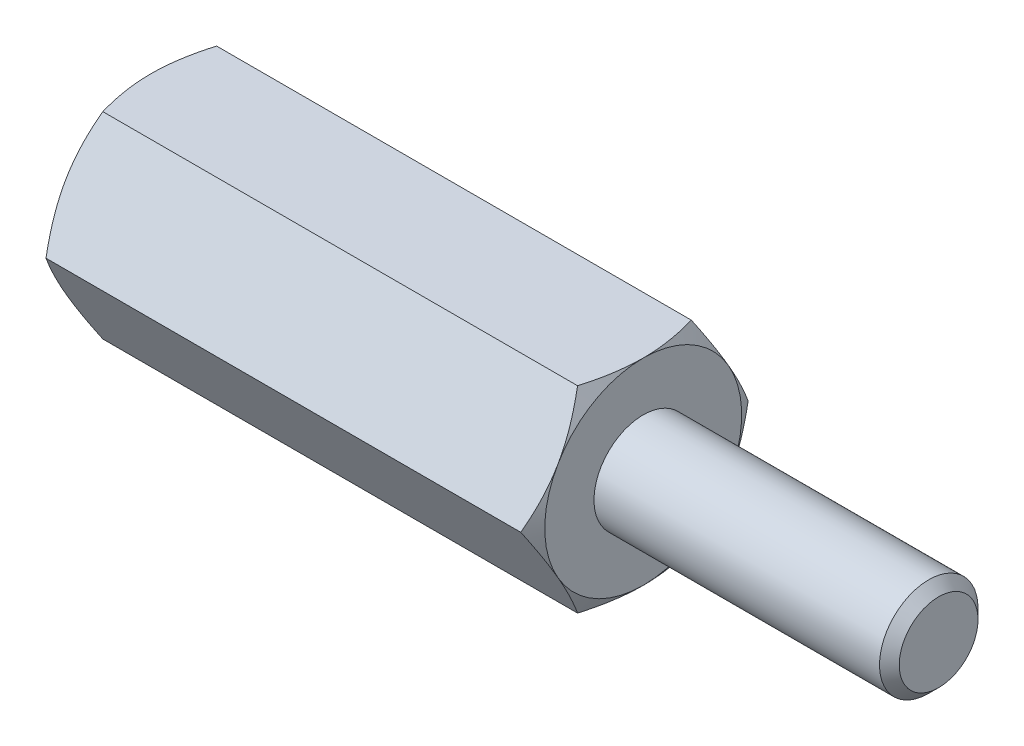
ISO-10303-21;
HEADER;
FILE_DESCRIPTION(('STEP AP214'),'2;1');
FILE_NAME('part.step','',(''),(''),'','','');
FILE_SCHEMA(('AUTOMOTIVE_DESIGN { 1 0 10303 214 1 1 1 1 }'));
ENDSEC;
DATA;
#1=APPLICATION_CONTEXT('core data for automotive mechanical design processes');
#2=APPLICATION_PROTOCOL_DEFINITION('international standard','automotive_design',2000,#1);
#3=PRODUCT_CONTEXT('',#1,'mechanical');
#4=PRODUCT('Part','Part','',(#3));
#5=PRODUCT_RELATED_PRODUCT_CATEGORY('part','',(#4));
#6=PRODUCT_DEFINITION_FORMATION('','',#4);
#7=PRODUCT_DEFINITION_CONTEXT('part definition',#1,'design');
#8=PRODUCT_DEFINITION('design','',#6,#7);
#9=PRODUCT_DEFINITION_SHAPE('','',#8);
#10=(LENGTH_UNIT() NAMED_UNIT(*) SI_UNIT(.MILLI.,.METRE.));
#11=(NAMED_UNIT(*) PLANE_ANGLE_UNIT() SI_UNIT($,.RADIAN.));
#12=(NAMED_UNIT(*) SI_UNIT($,.STERADIAN.) SOLID_ANGLE_UNIT());
#13=UNCERTAINTY_MEASURE_WITH_UNIT(LENGTH_MEASURE(1.E-05),#10,'distance_accuracy_value','');
#14=(GEOMETRIC_REPRESENTATION_CONTEXT(3) GLOBAL_UNCERTAINTY_ASSIGNED_CONTEXT((#13)) GLOBAL_UNIT_ASSIGNED_CONTEXT((#10,
#11,#12)) REPRESENTATION_CONTEXT('',''));
#15=CARTESIAN_POINT('',(0.,0.,0.));
#16=DIRECTION('',(0.,0.,1.));
#17=DIRECTION('',(1.,0.,0.));
#18=AXIS2_PLACEMENT_3D('',#15,#16,#17);
#19=CARTESIAN_POINT('',(5.,2.,-1.15470053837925));
#20=DIRECTION('',(1.,0.,0.));
#21=DIRECTION('',(0.,0.,-1.));
#22=AXIS2_PLACEMENT_3D('',#19,#20,#21);
#23=PLANE('',#22);
#24=CARTESIAN_POINT('',(5.,0.,0.));
#25=DIRECTION('',(1.,0.,0.));
#26=DIRECTION('',(0.,0.,-1.));
#27=AXIS2_PLACEMENT_3D('',#24,#25,#26);
#28=CIRCLE('',#27,2.);
#29=CARTESIAN_POINT('',(5.,-1.,-1.73205080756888));
#30=VERTEX_POINT('',#29);
#31=CARTESIAN_POINT('',(5.,0.999999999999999,-1.73205080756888));
#32=VERTEX_POINT('',#31);
#33=EDGE_CURVE('E288',#30,#32,#28,.T.);
#34=ORIENTED_EDGE('',*,*,#33,.T.);
#35=CARTESIAN_POINT('',(5.,2.,0.));
#36=VERTEX_POINT('',#35);
#37=EDGE_CURVE('E53',#32,#36,#28,.T.);
#38=ORIENTED_EDGE('',*,*,#37,.T.);
#39=CARTESIAN_POINT('',(5.,1.,1.73205080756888));
#40=VERTEX_POINT('',#39);
#41=EDGE_CURVE('E297',#36,#40,#28,.T.);
#42=ORIENTED_EDGE('',*,*,#41,.T.);
#43=CARTESIAN_POINT('',(5.,-1.,1.73205080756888));
#44=VERTEX_POINT('',#43);
#45=EDGE_CURVE('E300',#40,#44,#28,.T.);
#46=ORIENTED_EDGE('',*,*,#45,.T.);
#47=CARTESIAN_POINT('',(5.,0.,0.));
#48=DIRECTION('',(-1.,0.,0.));
#49=DIRECTION('',(0.,-1.,0.));
#50=AXIS2_PLACEMENT_3D('',#47,#48,#49);
#51=CIRCLE('',#50,2.);
#52=CARTESIAN_POINT('',(5.,-2.,0.));
#53=VERTEX_POINT('',#52);
#54=EDGE_CURVE('E193',#53,#44,#51,.T.);
#55=ORIENTED_EDGE('',*,*,#54,.F.);
#56=EDGE_CURVE('E61',#53,#30,#28,.T.);
#57=ORIENTED_EDGE('',*,*,#56,.T.);
#58=EDGE_LOOP('',(#34,#38,#42,#46,#55,#57));
#59=FACE_BOUND('',#58,.T.);
#60=CARTESIAN_POINT('',(5.,0.,0.));
#61=DIRECTION('',(1.,0.,0.));
#62=DIRECTION('',(0.,0.,-1.));
#63=AXIS2_PLACEMENT_3D('',#60,#61,#62);
#64=CIRCLE('',#63,1.);
#65=CARTESIAN_POINT('',(5.,0.,-1.));
#66=VERTEX_POINT('',#65);
#67=EDGE_CURVE('E315',#66,#66,#64,.T.);
#68=ORIENTED_EDGE('',*,*,#67,.F.);
#69=EDGE_LOOP('',(#68));
#70=FACE_BOUND('',#69,.T.);
#71=ADVANCED_FACE('F37',(#59,#70),#23,.T.);
#72=CARTESIAN_POINT('',(5.,0.,-2.3094010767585));
#73=DIRECTION('',(0.,-0.5,0.866025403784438));
#74=DIRECTION('',(0.,-0.866025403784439,-0.5));
#75=AXIS2_PLACEMENT_3D('',#72,#73,#74);
#76=PLANE('',#75);
#77=CARTESIAN_POINT('',(4.8213005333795,-0.000200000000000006,-2.30951654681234));
#78=CARTESIAN_POINT('',(4.85061046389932,0.0876912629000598,-2.25877250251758));
#79=CARTESIAN_POINT('',(4.87726714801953,0.176341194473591,-2.20759044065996));
#80=CARTESIAN_POINT('',(4.92379750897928,0.355176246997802,-2.10433997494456));
#81=CARTESIAN_POINT('',(4.94365472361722,0.445364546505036,-2.05226973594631));
#82=CARTESIAN_POINT('',(4.97456653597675,0.624623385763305,-1.94877459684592));
#83=CARTESIAN_POINT('',(4.98582684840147,0.713666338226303,-1.89736562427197));
#84=CARTESIAN_POINT('',(4.99927133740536,0.892171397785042,-1.79430568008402));
#85=CARTESIAN_POINT('',(5.00146664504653,0.981632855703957,-1.74265508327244));
#86=CARTESIAN_POINT('',(4.99690901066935,1.1488083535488,-1.64613626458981));
#87=CARTESIAN_POINT('',(4.99127512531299,1.22654737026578,-1.60125362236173));
#88=CARTESIAN_POINT('',(4.97341610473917,1.38151891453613,-1.51178075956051));
#89=CARTESIAN_POINT('',(4.96118486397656,1.4587509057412,-1.46719084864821));
#90=CARTESIAN_POINT('',(4.93060656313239,1.6140421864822,-1.37753338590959));
#91=CARTESIAN_POINT('',(4.91212983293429,1.69208181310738,-1.33247718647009));
#92=CARTESIAN_POINT('',(4.87019448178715,1.84699686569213,-1.24303693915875));
#93=CARTESIAN_POINT('',(4.84674571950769,1.92387427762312,-1.1986517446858));
#94=CARTESIAN_POINT('',(4.8213005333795,2.0002,-1.15458506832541));
#95=B_SPLINE_CURVE_WITH_KNOTS('',3,(#77,#78,#79,#80,#81,#82,#83,#84,#85,#86,#87,#88,#89,#90,#91,
#92,#93,#94),.UNSPECIFIED.,.F.,.F.,(4,2,2,2,2,2,2,2,4),(0.,0.317031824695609,0.634825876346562,
0.944753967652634,1.25430138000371,1.52387047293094,1.79368946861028,2.06949491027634,
2.34475850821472),.UNSPECIFIED.);
#96=CARTESIAN_POINT('',(4.82136720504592,0.,-2.3094010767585));
#97=VERTEX_POINT('',#96);
#98=EDGE_CURVE('E312',#97,#32,#95,.T.);
#99=ORIENTED_EDGE('',*,*,#98,.F.);
#100=DIRECTION('',(-1.,0.,0.));
#101=VECTOR('',#100,1.);
#102=CARTESIAN_POINT('',(5.,0.,-2.3094010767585));
#103=LINE('',#102,#101);
#104=CARTESIAN_POINT('',(-4.82136720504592,0.,-2.3094010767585));
#105=VERTEX_POINT('',#104);
#106=EDGE_CURVE('E264',#97,#105,#103,.T.);
#107=ORIENTED_EDGE('',*,*,#106,.T.);
#108=CARTESIAN_POINT('',(-4.8213005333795,2.0002,-1.15458506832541));
#109=CARTESIAN_POINT('',(-4.85061046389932,1.91230873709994,-1.20532911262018));
#110=CARTESIAN_POINT('',(-4.87726714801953,1.82365880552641,-1.2565111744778));
#111=CARTESIAN_POINT('',(-4.92379750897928,1.6448237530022,-1.35976164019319));
#112=CARTESIAN_POINT('',(-4.94365472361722,1.55463545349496,-1.41183187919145));
#113=CARTESIAN_POINT('',(-4.97456653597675,1.37537661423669,-1.51532701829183));
#114=CARTESIAN_POINT('',(-4.98582684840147,1.2863336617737,-1.56673599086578));
#115=CARTESIAN_POINT('',(-4.99927133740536,1.10782860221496,-1.66979593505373));
#116=CARTESIAN_POINT('',(-5.00146664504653,1.01836714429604,-1.72144653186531));
#117=CARTESIAN_POINT('',(-4.99690901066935,0.851191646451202,-1.81796535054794));
#118=CARTESIAN_POINT('',(-4.99127512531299,0.773452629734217,-1.86284799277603));
#119=CARTESIAN_POINT('',(-4.97341610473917,0.618481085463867,-1.95232085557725));
#120=CARTESIAN_POINT('',(-4.96118486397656,0.541249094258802,-1.99691076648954));
#121=CARTESIAN_POINT('',(-4.93060656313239,0.385957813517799,-2.08656822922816));
#122=CARTESIAN_POINT('',(-4.91212983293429,0.30791818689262,-2.13162442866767));
#123=CARTESIAN_POINT('',(-4.87019448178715,0.153003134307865,-2.221064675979));
#124=CARTESIAN_POINT('',(-4.84674571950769,0.0761257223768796,-2.26544987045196));
#125=CARTESIAN_POINT('',(-4.8213005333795,-0.000200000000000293,-2.30951654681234));
#126=B_SPLINE_CURVE_WITH_KNOTS('',3,(#108,#109,#110,#111,#112,#113,#114,#115,#116,#117,#118,
#119,#120,#121,#122,#123,#124,#125),.UNSPECIFIED.,.F.,.F.,(4,2,2,2,2,2,2,2,4),(0.,
0.317031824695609,0.634825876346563,0.944753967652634,1.25430138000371,1.52387047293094,
1.79368946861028,2.06949491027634,2.34475850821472),.UNSPECIFIED.);
#127=CARTESIAN_POINT('',(-5.,0.999999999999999,-1.73205080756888));
#128=VERTEX_POINT('',#127);
#129=EDGE_CURVE('E323',#128,#105,#126,.T.);
#130=ORIENTED_EDGE('',*,*,#129,.F.);
#131=CARTESIAN_POINT('',(-4.82136720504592,2.,-1.15470053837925));
#132=VERTEX_POINT('',#131);
#133=EDGE_CURVE('E325',#132,#128,#126,.T.);
#134=ORIENTED_EDGE('',*,*,#133,.F.);
#135=DIRECTION('',(-1.,0.,0.));
#136=VECTOR('',#135,1.);
#137=CARTESIAN_POINT('',(5.,2.,-1.15470053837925));
#138=LINE('',#137,#136);
#139=CARTESIAN_POINT('',(4.821367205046,2.,-1.15470053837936));
#140=VERTEX_POINT('',#139);
#141=EDGE_CURVE('E279',#140,#132,#138,.T.);
#142=ORIENTED_EDGE('',*,*,#141,.F.);
#143=EDGE_CURVE('E229',#32,#140,#95,.T.);
#144=ORIENTED_EDGE('',*,*,#143,.F.);
#145=EDGE_LOOP('',(#99,#107,#130,#134,#142,#144));
#146=FACE_BOUND('',#145,.T.);
#147=ADVANCED_FACE('F148',(#146),#76,.F.);
#148=CARTESIAN_POINT('',(5.,2.,-1.15470053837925));
#149=DIRECTION('',(0.,-1.,0.));
#150=DIRECTION('',(0.,0.,-1.));
#151=AXIS2_PLACEMENT_3D('',#148,#149,#150);
#152=PLANE('',#151);
#153=CARTESIAN_POINT('',(4.0041453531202,2.,-3.14239762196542));
#154=CARTESIAN_POINT('',(4.04685680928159,2.,-3.05468337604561));
#155=CARTESIAN_POINT('',(4.08917030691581,2.,-2.96677207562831));
#156=CARTESIAN_POINT('',(4.17277831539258,2.,-2.79045070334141));
#157=CARTESIAN_POINT('',(4.21407267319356,2.,-2.70204055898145));
#158=CARTESIAN_POINT('',(4.29561838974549,2.,-2.52418069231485));
#159=CARTESIAN_POINT('',(4.33586319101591,2.,-2.43472795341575));
#160=CARTESIAN_POINT('',(4.41475904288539,2.,-2.25512498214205));
#161=CARTESIAN_POINT('',(4.45341016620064,2.,-2.16497478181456));
#162=CARTESIAN_POINT('',(4.52996617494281,2.,-1.98078525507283));
#163=CARTESIAN_POINT('',(4.56780217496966,2.,-1.88671714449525));
#164=CARTESIAN_POINT('',(4.64070044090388,2.,-1.69751412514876));
#165=CARTESIAN_POINT('',(4.67576294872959,2.,-1.60237931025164));
#166=CARTESIAN_POINT('',(4.74223535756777,2.,-1.41102905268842));
#167=CARTESIAN_POINT('',(4.77365196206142,2.,-1.31481596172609));
#168=CARTESIAN_POINT('',(4.83184764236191,2.,-1.12101028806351));
#169=CARTESIAN_POINT('',(4.8586281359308,2.,-1.02341813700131));
#170=CARTESIAN_POINT('',(4.90615162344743,2.,-0.827336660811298));
#171=CARTESIAN_POINT('',(4.9269281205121,2.,-0.728855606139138));
#172=CARTESIAN_POINT('',(4.96129559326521,2.,-0.530628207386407));
#173=CARTESIAN_POINT('',(4.97488733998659,2.,-0.430882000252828));
#174=CARTESIAN_POINT('',(4.99362159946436,2.,-0.231937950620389));
#175=CARTESIAN_POINT('',(4.99887592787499,2.,-0.132750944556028));
#176=CARTESIAN_POINT('',(5.00079968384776,2.,0.0657049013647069));
#177=CARTESIAN_POINT('',(4.9974689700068,2.,0.164973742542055));
#178=CARTESIAN_POINT('',(4.97965125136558,2.,0.400692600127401));
#179=CARTESIAN_POINT('',(4.96138848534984,2.,0.536859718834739));
#180=CARTESIAN_POINT('',(4.91179958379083,2.,0.806792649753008));
#181=CARTESIAN_POINT('',(4.88046153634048,2.,0.9405561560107));
#182=CARTESIAN_POINT('',(4.80733694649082,2.,1.20849227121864));
#183=CARTESIAN_POINT('',(4.76532316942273,2.,1.34260127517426));
#184=CARTESIAN_POINT('',(4.69701155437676,2.,1.54188460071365));
#185=CARTESIAN_POINT('',(4.67336125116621,2.,1.6079939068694));
#186=CARTESIAN_POINT('',(4.62457310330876,2.,1.73966131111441));
#187=CARTESIAN_POINT('',(4.59943529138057,2.,1.80521942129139));
#188=CARTESIAN_POINT('',(4.53045244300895,2.,1.98014362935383));
#189=CARTESIAN_POINT('',(4.48548288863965,2.,2.08906517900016));
#190=CARTESIAN_POINT('',(4.39293953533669,2.,2.3058004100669));
#191=CARTESIAN_POINT('',(4.34536546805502,2.,2.41361397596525));
#192=CARTESIAN_POINT('',(4.24822629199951,2.,2.62838132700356));
#193=CARTESIAN_POINT('',(4.19866051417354,2.,2.7353348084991));
#194=CARTESIAN_POINT('',(4.09800140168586,2.,2.94852186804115));
#195=CARTESIAN_POINT('',(4.04690802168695,2.,3.05475542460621));
#196=CARTESIAN_POINT('',(3.89169615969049,2.,3.37291303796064));
#197=CARTESIAN_POINT('',(3.78579652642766,2.,3.58396705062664));
#198=CARTESIAN_POINT('',(3.57100981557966,2.,4.00448363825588));
#199=CARTESIAN_POINT('',(3.46212334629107,2.,4.21394652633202));
#200=CARTESIAN_POINT('',(3.25376773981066,2.,4.61000648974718));
#201=CARTESIAN_POINT('',(3.15450073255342,2.,4.79671008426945));
#202=CARTESIAN_POINT('',(2.95476413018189,2.,5.16948614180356));
#203=CARTESIAN_POINT('',(2.85429446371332,2.,5.35555856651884));
#204=CARTESIAN_POINT('',(2.6527937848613,2.,5.72660635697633));
#205=CARTESIAN_POINT('',(2.55176570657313,2.,5.91158331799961));
#206=CARTESIAN_POINT('',(2.34902395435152,2.,6.28114276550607));
#207=CARTESIAN_POINT('',(2.24731033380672,2.,6.46572528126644));
#208=CARTESIAN_POINT('',(2.14534707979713,2.,6.65016883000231));
#209=B_SPLINE_CURVE_WITH_KNOTS('',3,(#153,#154,#155,#156,#157,#158,#159,#160,#161,#162,#163,
#164,#165,#166,#167,#168,#169,#170,#171,#172,#173,#174,#175,#176,#177,#178,#179,#180,#181,#182,
#183,#184,#185,#186,#187,#188,#189,#190,#191,#192,#193,#194,#195,#196,#197,#198,#199,#200,#201,
#202,#203,#204,#205,#206,#207,#208),.UNSPECIFIED.,.F.,.F.,(4,2,2,2,2,2,2,2,2,2,2,2,2,2,2,2,2,2,
2,2,2,2,2,2,2,2,2,4),(0.,0.292684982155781,0.585413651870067,0.879667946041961,1.17390879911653,
1.47805164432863,1.78216793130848,2.08571589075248,2.38917085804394,2.690898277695,
2.99259331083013,3.29020694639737,3.58782548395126,3.99913738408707,4.41082482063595,
4.83214112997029,5.0427662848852,5.25338680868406,5.60685637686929,5.96036243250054,
6.31398824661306,6.66762456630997,7.37597688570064,8.08418599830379,8.71853756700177,
9.3529269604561,9.98522933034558,10.6174830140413),.UNSPECIFIED.);
#210=EDGE_CURVE('E227',#140,#36,#209,.T.);
#211=ORIENTED_EDGE('',*,*,#210,.F.);
#212=ORIENTED_EDGE('',*,*,#141,.T.);
#213=CARTESIAN_POINT('',(-4.0041453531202,2.,-3.14239762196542));
#214=CARTESIAN_POINT('',(-4.04685680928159,2.,-3.05468337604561));
#215=CARTESIAN_POINT('',(-4.08917030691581,2.,-2.96677207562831));
#216=CARTESIAN_POINT('',(-4.17277831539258,2.,-2.79045070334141));
#217=CARTESIAN_POINT('',(-4.21407267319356,2.,-2.70204055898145));
#218=CARTESIAN_POINT('',(-4.29561838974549,2.,-2.52418069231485));
#219=CARTESIAN_POINT('',(-4.33586319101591,2.,-2.43472795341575));
#220=CARTESIAN_POINT('',(-4.41475904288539,2.,-2.25512498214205));
#221=CARTESIAN_POINT('',(-4.45341016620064,2.,-2.16497478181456));
#222=CARTESIAN_POINT('',(-4.52996617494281,2.,-1.98078525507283));
#223=CARTESIAN_POINT('',(-4.56780217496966,2.,-1.88671714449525));
#224=CARTESIAN_POINT('',(-4.64070044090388,2.,-1.69751412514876));
#225=CARTESIAN_POINT('',(-4.67576294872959,2.,-1.60237931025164));
#226=CARTESIAN_POINT('',(-4.74223535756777,2.,-1.41102905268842));
#227=CARTESIAN_POINT('',(-4.77365196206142,2.,-1.31481596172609));
#228=CARTESIAN_POINT('',(-4.83184764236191,2.,-1.12101028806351));
#229=CARTESIAN_POINT('',(-4.8586281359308,2.,-1.02341813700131));
#230=CARTESIAN_POINT('',(-4.90615162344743,2.,-0.827336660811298));
#231=CARTESIAN_POINT('',(-4.9269281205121,2.,-0.728855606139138));
#232=CARTESIAN_POINT('',(-4.96129559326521,2.,-0.530628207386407));
#233=CARTESIAN_POINT('',(-4.97488733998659,2.,-0.430882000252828));
#234=CARTESIAN_POINT('',(-4.99362159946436,2.,-0.231937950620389));
#235=CARTESIAN_POINT('',(-4.99887592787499,2.,-0.132750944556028));
#236=CARTESIAN_POINT('',(-5.00079968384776,2.,0.0657049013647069));
#237=CARTESIAN_POINT('',(-4.9974689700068,2.,0.164973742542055));
#238=CARTESIAN_POINT('',(-4.97965125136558,2.,0.400692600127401));
#239=CARTESIAN_POINT('',(-4.96138848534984,2.,0.53685971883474));
#240=CARTESIAN_POINT('',(-4.91179958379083,2.,0.806792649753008));
#241=CARTESIAN_POINT('',(-4.88046153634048,2.,0.940556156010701));
#242=CARTESIAN_POINT('',(-4.80733694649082,2.,1.20849227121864));
#243=CARTESIAN_POINT('',(-4.76532316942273,2.,1.34260127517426));
#244=CARTESIAN_POINT('',(-4.69701155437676,2.,1.54188460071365));
#245=CARTESIAN_POINT('',(-4.67336125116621,2.,1.60799390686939));
#246=CARTESIAN_POINT('',(-4.62457310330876,2.,1.73966131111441));
#247=CARTESIAN_POINT('',(-4.59943529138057,2.,1.80521942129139));
#248=CARTESIAN_POINT('',(-4.53045244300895,2.,1.98014362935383));
#249=CARTESIAN_POINT('',(-4.48548288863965,2.,2.08906517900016));
#250=CARTESIAN_POINT('',(-4.39293953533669,2.,2.3058004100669));
#251=CARTESIAN_POINT('',(-4.34536546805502,2.,2.41361397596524));
#252=CARTESIAN_POINT('',(-4.24822629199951,2.,2.62838132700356));
#253=CARTESIAN_POINT('',(-4.19866051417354,2.,2.7353348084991));
#254=CARTESIAN_POINT('',(-4.09800140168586,2.,2.94852186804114));
#255=CARTESIAN_POINT('',(-4.04690802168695,2.,3.05475542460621));
#256=CARTESIAN_POINT('',(-3.89169615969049,2.,3.37291303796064));
#257=CARTESIAN_POINT('',(-3.78579652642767,2.,3.58396705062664));
#258=CARTESIAN_POINT('',(-3.57100981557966,2.,4.00448363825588));
#259=CARTESIAN_POINT('',(-3.46212334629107,2.,4.21394652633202));
#260=CARTESIAN_POINT('',(-3.25376773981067,2.,4.61000648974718));
#261=CARTESIAN_POINT('',(-3.15450073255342,2.,4.79671008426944));
#262=CARTESIAN_POINT('',(-2.95476413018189,2.,5.16948614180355));
#263=CARTESIAN_POINT('',(-2.85429446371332,2.,5.35555856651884));
#264=CARTESIAN_POINT('',(-2.6527937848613,2.,5.72660635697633));
#265=CARTESIAN_POINT('',(-2.55176570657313,2.,5.9115833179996));
#266=CARTESIAN_POINT('',(-2.34902395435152,2.,6.28114276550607));
#267=CARTESIAN_POINT('',(-2.24731033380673,2.,6.46572528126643));
#268=CARTESIAN_POINT('',(-2.14534707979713,2.,6.65016883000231));
#269=B_SPLINE_CURVE_WITH_KNOTS('',3,(#213,#214,#215,#216,#217,#218,#219,#220,#221,#222,#223,
#224,#225,#226,#227,#228,#229,#230,#231,#232,#233,#234,#235,#236,#237,#238,#239,#240,#241,#242,
#243,#244,#245,#246,#247,#248,#249,#250,#251,#252,#253,#254,#255,#256,#257,#258,#259,#260,#261,
#262,#263,#264,#265,#266,#267,#268),.UNSPECIFIED.,.F.,.F.,(4,2,2,2,2,2,2,2,2,2,2,2,2,2,2,2,2,2,
2,2,2,2,2,2,2,2,2,4),(0.,0.292684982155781,0.585413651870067,0.879667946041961,1.17390879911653,
1.47805164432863,1.78216793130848,2.08571589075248,2.38917085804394,2.690898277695,
2.99259331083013,3.29020694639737,3.58782548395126,3.99913738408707,4.41082482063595,
4.8321411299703,5.0427662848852,5.25338680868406,5.60685637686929,5.96036243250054,
6.31398824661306,6.66762456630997,7.37597688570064,8.08418599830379,8.71853756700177,
9.3529269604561,9.98522933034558,10.6174830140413),.UNSPECIFIED.);
#270=CARTESIAN_POINT('',(-5.,2.,0.));
#271=VERTEX_POINT('',#270);
#272=EDGE_CURVE('E241',#271,#132,#269,.F.);
#273=ORIENTED_EDGE('',*,*,#272,.F.);
#274=CARTESIAN_POINT('',(-4.82136720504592,2.,1.15470053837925));
#275=VERTEX_POINT('',#274);
#276=EDGE_CURVE('E249',#275,#271,#269,.F.);
#277=ORIENTED_EDGE('',*,*,#276,.F.);
#278=DIRECTION('',(-1.,0.,0.));
#279=VECTOR('',#278,1.);
#280=CARTESIAN_POINT('',(5.,2.,1.15470053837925));
#281=LINE('',#280,#279);
#282=CARTESIAN_POINT('',(4.82136720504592,2.,1.15470053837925));
#283=VERTEX_POINT('',#282);
#284=EDGE_CURVE('E276',#283,#275,#281,.T.);
#285=ORIENTED_EDGE('',*,*,#284,.F.);
#286=EDGE_CURVE('E221',#36,#283,#209,.T.);
#287=ORIENTED_EDGE('',*,*,#286,.F.);
#288=EDGE_LOOP('',(#211,#212,#273,#277,#285,#287));
#289=FACE_BOUND('',#288,.T.);
#290=ADVANCED_FACE('F153',(#289),#152,.F.);
#291=CARTESIAN_POINT('',(5.,2.,1.15470053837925));
#292=DIRECTION('',(0.,-0.5,-0.866025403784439));
#293=DIRECTION('',(0.,0.866025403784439,-0.5));
#294=AXIS2_PLACEMENT_3D('',#291,#292,#293);
#295=PLANE('',#294);
#296=CARTESIAN_POINT('',(4.8213005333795,2.0002,1.15458506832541));
#297=CARTESIAN_POINT('',(4.85061046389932,1.91230873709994,1.20532911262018));
#298=CARTESIAN_POINT('',(4.87726714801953,1.82365880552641,1.2565111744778));
#299=CARTESIAN_POINT('',(4.92379750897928,1.6448237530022,1.35976164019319));
#300=CARTESIAN_POINT('',(4.94365472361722,1.55463545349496,1.41183187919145));
#301=CARTESIAN_POINT('',(4.97456653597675,1.37537661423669,1.51532701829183));
#302=CARTESIAN_POINT('',(4.98582684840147,1.2863336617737,1.56673599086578));
#303=CARTESIAN_POINT('',(4.99927133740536,1.10782860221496,1.66979593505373));
#304=CARTESIAN_POINT('',(5.00146664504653,1.01836714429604,1.72144653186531));
#305=CARTESIAN_POINT('',(4.99690901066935,0.851191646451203,1.81796535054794));
#306=CARTESIAN_POINT('',(4.99127512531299,0.773452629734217,1.86284799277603));
#307=CARTESIAN_POINT('',(4.97341610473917,0.618481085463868,1.95232085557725));
#308=CARTESIAN_POINT('',(4.96118486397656,0.541249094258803,1.99691076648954));
#309=CARTESIAN_POINT('',(4.93060656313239,0.3859578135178,2.08656822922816));
#310=CARTESIAN_POINT('',(4.91212983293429,0.307918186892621,2.13162442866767));
#311=CARTESIAN_POINT('',(4.87019448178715,0.153003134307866,2.221064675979));
#312=CARTESIAN_POINT('',(4.84674571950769,0.0761257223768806,2.26544987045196));
#313=CARTESIAN_POINT('',(4.8213005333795,-0.000199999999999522,2.30951654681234));
#314=B_SPLINE_CURVE_WITH_KNOTS('',3,(#296,#297,#298,#299,#300,#301,#302,#303,#304,#305,#306,
#307,#308,#309,#310,#311,#312,#313),.UNSPECIFIED.,.F.,.F.,(4,2,2,2,2,2,2,2,4),(0.,
0.317031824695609,0.634825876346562,0.944753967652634,1.25430138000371,1.52387047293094,
1.79368946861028,2.06949491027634,2.34475850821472),.UNSPECIFIED.);
#315=EDGE_CURVE('E228',#283,#40,#314,.T.);
#316=ORIENTED_EDGE('',*,*,#315,.F.);
#317=ORIENTED_EDGE('',*,*,#284,.T.);
#318=CARTESIAN_POINT('',(-4.8213005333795,-0.000199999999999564,2.30951654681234));
#319=CARTESIAN_POINT('',(-4.85061046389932,0.0876912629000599,2.25877250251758));
#320=CARTESIAN_POINT('',(-4.87726714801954,0.176341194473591,2.20759044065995));
#321=CARTESIAN_POINT('',(-4.92379750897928,0.355176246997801,2.10433997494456));
#322=CARTESIAN_POINT('',(-4.94365472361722,0.445364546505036,2.0522697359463));
#323=CARTESIAN_POINT('',(-4.97456653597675,0.624623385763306,1.94877459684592));
#324=CARTESIAN_POINT('',(-4.98582684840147,0.713666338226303,1.89736562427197));
#325=CARTESIAN_POINT('',(-4.99927133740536,0.892171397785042,1.79430568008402));
#326=CARTESIAN_POINT('',(-5.00146664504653,0.981632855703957,1.74265508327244));
#327=CARTESIAN_POINT('',(-4.99690901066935,1.1488083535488,1.64613626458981));
#328=CARTESIAN_POINT('',(-4.99127512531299,1.22654737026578,1.60125362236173));
#329=CARTESIAN_POINT('',(-4.97341610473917,1.38151891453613,1.51178075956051));
#330=CARTESIAN_POINT('',(-4.96118486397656,1.4587509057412,1.46719084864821));
#331=CARTESIAN_POINT('',(-4.93060656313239,1.6140421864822,1.37753338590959));
#332=CARTESIAN_POINT('',(-4.91212983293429,1.69208181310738,1.33247718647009));
#333=CARTESIAN_POINT('',(-4.87019448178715,1.84699686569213,1.24303693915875));
#334=CARTESIAN_POINT('',(-4.84674571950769,1.92387427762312,1.1986517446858));
#335=CARTESIAN_POINT('',(-4.8213005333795,2.0002,1.15458506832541));
#336=B_SPLINE_CURVE_WITH_KNOTS('',3,(#318,#319,#320,#321,#322,#323,#324,#325,#326,#327,#328,
#329,#330,#331,#332,#333,#334,#335),.UNSPECIFIED.,.F.,.F.,(4,2,2,2,2,2,2,2,4),(0.,
0.317031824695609,0.634825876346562,0.944753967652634,1.25430138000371,1.52387047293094,
1.79368946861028,2.06949491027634,2.34475850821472),.UNSPECIFIED.);
#337=CARTESIAN_POINT('',(-5.,1.,1.73205080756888));
#338=VERTEX_POINT('',#337);
#339=EDGE_CURVE('E255',#338,#275,#336,.T.);
#340=ORIENTED_EDGE('',*,*,#339,.F.);
#341=CARTESIAN_POINT('',(-4.82136720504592,0.,2.3094010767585));
#342=VERTEX_POINT('',#341);
#343=EDGE_CURVE('E262',#342,#338,#336,.T.);
#344=ORIENTED_EDGE('',*,*,#343,.F.);
#345=DIRECTION('',(-1.,0.,0.));
#346=VECTOR('',#345,1.);
#347=CARTESIAN_POINT('',(5.,0.,2.3094010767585));
#348=LINE('',#347,#346);
#349=CARTESIAN_POINT('',(4.82136720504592,0.,2.3094010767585));
#350=VERTEX_POINT('',#349);
#351=EDGE_CURVE('E273',#350,#342,#348,.T.);
#352=ORIENTED_EDGE('',*,*,#351,.F.);
#353=EDGE_CURVE('E215',#40,#350,#314,.T.);
#354=ORIENTED_EDGE('',*,*,#353,.F.);
#355=EDGE_LOOP('',(#316,#317,#340,#344,#352,#354));
#356=FACE_BOUND('',#355,.T.);
#357=ADVANCED_FACE('F235',(#356),#295,.F.);
#358=CARTESIAN_POINT('',(5.,0.,2.3094010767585));
#359=DIRECTION('',(0.,0.5,-0.866025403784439));
#360=DIRECTION('',(0.,0.866025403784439,0.5));
#361=AXIS2_PLACEMENT_3D('',#358,#359,#360);
#362=PLANE('',#361);
#363=CARTESIAN_POINT('',(4.8213005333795,0.000200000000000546,2.30951654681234));
#364=CARTESIAN_POINT('',(4.85061046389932,-0.0876912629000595,2.25877250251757));
#365=CARTESIAN_POINT('',(4.87726714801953,-0.176341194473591,2.20759044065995));
#366=CARTESIAN_POINT('',(4.92379750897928,-0.355176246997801,2.10433997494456));
#367=CARTESIAN_POINT('',(4.94365472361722,-0.445364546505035,2.0522697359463));
#368=CARTESIAN_POINT('',(4.97456653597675,-0.624623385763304,1.94877459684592));
#369=CARTESIAN_POINT('',(4.98582684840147,-0.713666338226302,1.89736562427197));
#370=CARTESIAN_POINT('',(4.99927133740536,-0.892171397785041,1.79430568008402));
#371=CARTESIAN_POINT('',(5.00146664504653,-0.981632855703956,1.74265508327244));
#372=CARTESIAN_POINT('',(4.99690901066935,-1.1488083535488,1.64613626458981));
#373=CARTESIAN_POINT('',(4.99127512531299,-1.22654737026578,1.60125362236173));
#374=CARTESIAN_POINT('',(4.97341610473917,-1.38151891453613,1.51178075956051));
#375=CARTESIAN_POINT('',(4.96118486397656,-1.4587509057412,1.46719084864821));
#376=CARTESIAN_POINT('',(4.93060656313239,-1.6140421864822,1.37753338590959));
#377=CARTESIAN_POINT('',(4.91212983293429,-1.69208181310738,1.33247718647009));
#378=CARTESIAN_POINT('',(4.87019448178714,-1.84699686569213,1.24303693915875));
#379=CARTESIAN_POINT('',(4.84674571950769,-1.92387427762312,1.1986517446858));
#380=CARTESIAN_POINT('',(4.8213005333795,-2.0002,1.15458506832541));
#381=B_SPLINE_CURVE_WITH_KNOTS('',3,(#363,#364,#365,#366,#367,#368,#369,#370,#371,#372,#373,
#374,#375,#376,#377,#378,#379,#380),.UNSPECIFIED.,.F.,.F.,(4,2,2,2,2,2,2,2,4),(0.,
0.31703182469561,0.634825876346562,0.944753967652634,1.25430138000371,1.52387047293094,
1.79368946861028,2.06949491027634,2.34475850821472),.UNSPECIFIED.);
#382=EDGE_CURVE('E399',#350,#44,#381,.T.);
#383=ORIENTED_EDGE('',*,*,#382,.F.);
#384=ORIENTED_EDGE('',*,*,#351,.T.);
#385=CARTESIAN_POINT('',(-4.8213005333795,-2.0002,1.15458506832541));
#386=CARTESIAN_POINT('',(-4.85061046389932,-1.91230873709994,1.20532911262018));
#387=CARTESIAN_POINT('',(-4.87726714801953,-1.82365880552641,1.2565111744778));
#388=CARTESIAN_POINT('',(-4.92379750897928,-1.6448237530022,1.35976164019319));
#389=CARTESIAN_POINT('',(-4.94365472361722,-1.55463545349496,1.41183187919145));
#390=CARTESIAN_POINT('',(-4.97456653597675,-1.3753766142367,1.51532701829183));
#391=CARTESIAN_POINT('',(-4.98582684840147,-1.2863336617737,1.56673599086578));
#392=CARTESIAN_POINT('',(-4.99927133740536,-1.10782860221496,1.66979593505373));
#393=CARTESIAN_POINT('',(-5.00146664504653,-1.01836714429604,1.72144653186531));
#394=CARTESIAN_POINT('',(-4.99690901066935,-0.851191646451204,1.81796535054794));
#395=CARTESIAN_POINT('',(-4.99127512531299,-0.773452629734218,1.86284799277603));
#396=CARTESIAN_POINT('',(-4.97341610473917,-0.618481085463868,1.95232085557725));
#397=CARTESIAN_POINT('',(-4.96118486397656,-0.541249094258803,1.99691076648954));
#398=CARTESIAN_POINT('',(-4.93060656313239,-0.3859578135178,2.08656822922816));
#399=CARTESIAN_POINT('',(-4.91212983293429,-0.307918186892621,2.13162442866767));
#400=CARTESIAN_POINT('',(-4.87019448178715,-0.153003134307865,2.221064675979));
#401=CARTESIAN_POINT('',(-4.84674571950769,-0.0761257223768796,2.26544987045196));
#402=CARTESIAN_POINT('',(-4.8213005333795,0.000200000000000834,2.30951654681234));
#403=B_SPLINE_CURVE_WITH_KNOTS('',3,(#385,#386,#387,#388,#389,#390,#391,#392,#393,#394,#395,
#396,#397,#398,#399,#400,#401,#402),.UNSPECIFIED.,.F.,.F.,(4,2,2,2,2,2,2,2,4),(0.,
0.317031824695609,0.634825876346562,0.944753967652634,1.25430138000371,1.52387047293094,
1.79368946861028,2.06949491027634,2.34475850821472),.UNSPECIFIED.);
#404=CARTESIAN_POINT('',(-5.,-1.,1.73205080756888));
#405=VERTEX_POINT('',#404);
#406=EDGE_CURVE('E263',#405,#342,#403,.T.);
#407=ORIENTED_EDGE('',*,*,#406,.F.);
#408=CARTESIAN_POINT('',(-4.82136720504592,-2.,1.15470053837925));
#409=VERTEX_POINT('',#408);
#410=EDGE_CURVE('E250',#409,#405,#403,.T.);
#411=ORIENTED_EDGE('',*,*,#410,.F.);
#412=DIRECTION('',(-1.,0.,0.));
#413=VECTOR('',#412,1.);
#414=CARTESIAN_POINT('',(5.,-2.,1.15470053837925));
#415=LINE('',#414,#413);
#416=CARTESIAN_POINT('',(4.82136720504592,-2.,1.15470053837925));
#417=VERTEX_POINT('',#416);
#418=EDGE_CURVE('E270',#417,#409,#415,.T.);
#419=ORIENTED_EDGE('',*,*,#418,.F.);
#420=EDGE_CURVE('E210',#44,#417,#381,.T.);
#421=ORIENTED_EDGE('',*,*,#420,.F.);
#422=EDGE_LOOP('',(#383,#384,#407,#411,#419,#421));
#423=FACE_BOUND('',#422,.T.);
#424=ADVANCED_FACE('F396',(#423),#362,.F.);
#425=CARTESIAN_POINT('',(5.,-2.,1.15470053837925));
#426=DIRECTION('',(0.,1.,0.));
#427=DIRECTION('',(0.,0.,1.));
#428=AXIS2_PLACEMENT_3D('',#425,#426,#427);
#429=PLANE('',#428);
#430=CARTESIAN_POINT('',(4.0041453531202,-2.,-3.14239762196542));
#431=CARTESIAN_POINT('',(4.04685680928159,-2.,-3.05468337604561));
#432=CARTESIAN_POINT('',(4.08917030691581,-2.,-2.96677207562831));
#433=CARTESIAN_POINT('',(4.17277831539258,-2.,-2.79045070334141));
#434=CARTESIAN_POINT('',(4.21407267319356,-2.,-2.70204055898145));
#435=CARTESIAN_POINT('',(4.29561838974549,-2.,-2.52418069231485));
#436=CARTESIAN_POINT('',(4.33586319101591,-2.,-2.43472795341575));
#437=CARTESIAN_POINT('',(4.41475904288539,-2.,-2.25512498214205));
#438=CARTESIAN_POINT('',(4.45341016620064,-2.,-2.16497478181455));
#439=CARTESIAN_POINT('',(4.52996617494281,-2.,-1.98078525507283));
#440=CARTESIAN_POINT('',(4.56780217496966,-2.,-1.88671714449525));
#441=CARTESIAN_POINT('',(4.64070044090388,-2.,-1.69751412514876));
#442=CARTESIAN_POINT('',(4.67576294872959,-2.,-1.60237931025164));
#443=CARTESIAN_POINT('',(4.74223535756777,-2.,-1.41102905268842));
#444=CARTESIAN_POINT('',(4.77365196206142,-2.,-1.31481596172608));
#445=CARTESIAN_POINT('',(4.83184764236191,-2.,-1.12101028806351));
#446=CARTESIAN_POINT('',(4.8586281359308,-2.,-1.02341813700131));
#447=CARTESIAN_POINT('',(4.90615162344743,-2.,-0.827336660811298));
#448=CARTESIAN_POINT('',(4.9269281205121,-2.,-0.728855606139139));
#449=CARTESIAN_POINT('',(4.96129559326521,-2.,-0.530628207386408));
#450=CARTESIAN_POINT('',(4.97488733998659,-2.,-0.430882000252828));
#451=CARTESIAN_POINT('',(4.99362159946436,-2.,-0.231937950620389));
#452=CARTESIAN_POINT('',(4.99887592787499,-2.,-0.132750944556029));
#453=CARTESIAN_POINT('',(5.00079968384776,-2.,0.065704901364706));
#454=CARTESIAN_POINT('',(4.9974689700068,-2.,0.164973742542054));
#455=CARTESIAN_POINT('',(4.97965125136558,-2.,0.400692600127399));
#456=CARTESIAN_POINT('',(4.96138848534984,-2.,0.536859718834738));
#457=CARTESIAN_POINT('',(4.91179958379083,-2.,0.806792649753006));
#458=CARTESIAN_POINT('',(4.88046153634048,-2.,0.940556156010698));
#459=CARTESIAN_POINT('',(4.80733694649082,-2.,1.20849227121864));
#460=CARTESIAN_POINT('',(4.76532316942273,-2.,1.34260127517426));
#461=CARTESIAN_POINT('',(4.69701155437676,-2.,1.54188460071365));
#462=CARTESIAN_POINT('',(4.67336125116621,-2.,1.60799390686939));
#463=CARTESIAN_POINT('',(4.62457310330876,-2.,1.7396613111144));
#464=CARTESIAN_POINT('',(4.59943529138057,-2.,1.80521942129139));
#465=CARTESIAN_POINT('',(4.53045244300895,-2.,1.98014362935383));
#466=CARTESIAN_POINT('',(4.48548288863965,-2.,2.08906517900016));
#467=CARTESIAN_POINT('',(4.39293953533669,-2.,2.3058004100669));
#468=CARTESIAN_POINT('',(4.34536546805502,-2.,2.41361397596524));
#469=CARTESIAN_POINT('',(4.24822629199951,-2.,2.62838132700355));
#470=CARTESIAN_POINT('',(4.19866051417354,-2.,2.7353348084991));
#471=CARTESIAN_POINT('',(4.09800140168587,-2.,2.94852186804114));
#472=CARTESIAN_POINT('',(4.04690802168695,-2.,3.05475542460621));
#473=CARTESIAN_POINT('',(3.89169615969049,-2.,3.37291303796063));
#474=CARTESIAN_POINT('',(3.78579652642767,-2.,3.58396705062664));
#475=CARTESIAN_POINT('',(3.57100981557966,-2.,4.00448363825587));
#476=CARTESIAN_POINT('',(3.46212334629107,-2.,4.21394652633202));
#477=CARTESIAN_POINT('',(3.25376773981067,-2.,4.61000648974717));
#478=CARTESIAN_POINT('',(3.15450073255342,-2.,4.79671008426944));
#479=CARTESIAN_POINT('',(2.95476413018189,-2.,5.16948614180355));
#480=CARTESIAN_POINT('',(2.85429446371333,-2.,5.35555856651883));
#481=CARTESIAN_POINT('',(2.6527937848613,-2.,5.72660635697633));
#482=CARTESIAN_POINT('',(2.55176570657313,-2.,5.9115833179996));
#483=CARTESIAN_POINT('',(2.34902395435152,-2.,6.28114276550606));
#484=CARTESIAN_POINT('',(2.24731033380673,-2.,6.46572528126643));
#485=CARTESIAN_POINT('',(2.14534707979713,-2.,6.6501688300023));
#486=B_SPLINE_CURVE_WITH_KNOTS('',3,(#430,#431,#432,#433,#434,#435,#436,#437,#438,#439,#440,
#441,#442,#443,#444,#445,#446,#447,#448,#449,#450,#451,#452,#453,#454,#455,#456,#457,#458,#459,
#460,#461,#462,#463,#464,#465,#466,#467,#468,#469,#470,#471,#472,#473,#474,#475,#476,#477,#478,
#479,#480,#481,#482,#483,#484,#485),.UNSPECIFIED.,.F.,.F.,(4,2,2,2,2,2,2,2,2,2,2,2,2,2,2,2,2,2,
2,2,2,2,2,2,2,2,2,4),(0.,0.292684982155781,0.585413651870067,0.879667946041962,1.17390879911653,
1.47805164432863,1.78216793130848,2.08571589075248,2.38917085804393,2.69089827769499,
2.99259331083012,3.29020694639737,3.58782548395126,3.99913738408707,4.41082482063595,
4.83214112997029,5.04276628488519,5.25338680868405,5.60685637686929,5.96036243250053,
6.31398824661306,6.66762456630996,7.37597688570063,8.08418599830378,8.71853756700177,
9.35292696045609,9.98522933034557,10.6174830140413),.UNSPECIFIED.);
#487=EDGE_CURVE('E411',#417,#53,#486,.F.);
#488=ORIENTED_EDGE('',*,*,#487,.F.);
#489=ORIENTED_EDGE('',*,*,#418,.T.);
#490=CARTESIAN_POINT('',(-4.0041453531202,-2.,-3.14239762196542));
#491=CARTESIAN_POINT('',(-4.04685680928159,-2.,-3.05468337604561));
#492=CARTESIAN_POINT('',(-4.08917030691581,-2.,-2.96677207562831));
#493=CARTESIAN_POINT('',(-4.17277831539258,-2.,-2.79045070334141));
#494=CARTESIAN_POINT('',(-4.21407267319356,-2.,-2.70204055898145));
#495=CARTESIAN_POINT('',(-4.29561838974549,-2.,-2.52418069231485));
#496=CARTESIAN_POINT('',(-4.33586319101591,-2.,-2.43472795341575));
#497=CARTESIAN_POINT('',(-4.41475904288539,-2.,-2.25512498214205));
#498=CARTESIAN_POINT('',(-4.45341016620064,-2.,-2.16497478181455));
#499=CARTESIAN_POINT('',(-4.52996617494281,-2.,-1.98078525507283));
#500=CARTESIAN_POINT('',(-4.56780217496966,-2.,-1.88671714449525));
#501=CARTESIAN_POINT('',(-4.64070044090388,-2.,-1.69751412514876));
#502=CARTESIAN_POINT('',(-4.67576294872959,-2.,-1.60237931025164));
#503=CARTESIAN_POINT('',(-4.74223535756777,-2.,-1.41102905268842));
#504=CARTESIAN_POINT('',(-4.77365196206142,-2.,-1.31481596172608));
#505=CARTESIAN_POINT('',(-4.83184764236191,-2.,-1.12101028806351));
#506=CARTESIAN_POINT('',(-4.8586281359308,-2.,-1.02341813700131));
#507=CARTESIAN_POINT('',(-4.90615162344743,-2.,-0.827336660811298));
#508=CARTESIAN_POINT('',(-4.9269281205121,-2.,-0.728855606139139));
#509=CARTESIAN_POINT('',(-4.96129559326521,-2.,-0.530628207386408));
#510=CARTESIAN_POINT('',(-4.97488733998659,-2.,-0.430882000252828));
#511=CARTESIAN_POINT('',(-4.99362159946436,-2.,-0.23193795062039));
#512=CARTESIAN_POINT('',(-4.99887592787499,-2.,-0.132750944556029));
#513=CARTESIAN_POINT('',(-5.00079968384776,-2.,0.0657049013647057));
#514=CARTESIAN_POINT('',(-4.9974689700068,-2.,0.164973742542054));
#515=CARTESIAN_POINT('',(-4.97965125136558,-2.,0.400692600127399));
#516=CARTESIAN_POINT('',(-4.96138848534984,-2.,0.536859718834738));
#517=CARTESIAN_POINT('',(-4.91179958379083,-2.,0.806792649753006));
#518=CARTESIAN_POINT('',(-4.88046153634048,-2.,0.940556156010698));
#519=CARTESIAN_POINT('',(-4.80733694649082,-2.,1.20849227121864));
#520=CARTESIAN_POINT('',(-4.76532316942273,-2.,1.34260127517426));
#521=CARTESIAN_POINT('',(-4.69701155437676,-2.,1.54188460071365));
#522=CARTESIAN_POINT('',(-4.67336125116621,-2.,1.60799390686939));
#523=CARTESIAN_POINT('',(-4.62457310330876,-2.,1.7396613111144));
#524=CARTESIAN_POINT('',(-4.59943529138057,-2.,1.80521942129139));
#525=CARTESIAN_POINT('',(-4.53045244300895,-2.,1.98014362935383));
#526=CARTESIAN_POINT('',(-4.48548288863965,-2.,2.08906517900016));
#527=CARTESIAN_POINT('',(-4.39293953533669,-2.,2.3058004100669));
#528=CARTESIAN_POINT('',(-4.34536546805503,-2.,2.41361397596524));
#529=CARTESIAN_POINT('',(-4.24822629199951,-2.,2.62838132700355));
#530=CARTESIAN_POINT('',(-4.19866051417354,-2.,2.7353348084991));
#531=CARTESIAN_POINT('',(-4.09800140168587,-2.,2.94852186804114));
#532=CARTESIAN_POINT('',(-4.04690802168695,-2.,3.05475542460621));
#533=CARTESIAN_POINT('',(-3.89169615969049,-2.,3.37291303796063));
#534=CARTESIAN_POINT('',(-3.78579652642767,-2.,3.58396705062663));
#535=CARTESIAN_POINT('',(-3.57100981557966,-2.,4.00448363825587));
#536=CARTESIAN_POINT('',(-3.46212334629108,-2.,4.21394652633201));
#537=CARTESIAN_POINT('',(-3.25376773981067,-2.,4.61000648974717));
#538=CARTESIAN_POINT('',(-3.15450073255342,-2.,4.79671008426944));
#539=CARTESIAN_POINT('',(-2.95476413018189,-2.,5.16948614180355));
#540=CARTESIAN_POINT('',(-2.85429446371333,-2.,5.35555856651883));
#541=CARTESIAN_POINT('',(-2.6527937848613,-2.,5.72660635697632));
#542=CARTESIAN_POINT('',(-2.55176570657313,-2.,5.9115833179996));
#543=CARTESIAN_POINT('',(-2.34902395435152,-2.,6.28114276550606));
#544=CARTESIAN_POINT('',(-2.24731033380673,-2.,6.46572528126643));
#545=CARTESIAN_POINT('',(-2.14534707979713,-2.,6.6501688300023));
#546=B_SPLINE_CURVE_WITH_KNOTS('',3,(#490,#491,#492,#493,#494,#495,#496,#497,#498,#499,#500,
#501,#502,#503,#504,#505,#506,#507,#508,#509,#510,#511,#512,#513,#514,#515,#516,#517,#518,#519,
#520,#521,#522,#523,#524,#525,#526,#527,#528,#529,#530,#531,#532,#533,#534,#535,#536,#537,#538,
#539,#540,#541,#542,#543,#544,#545),.UNSPECIFIED.,.F.,.F.,(4,2,2,2,2,2,2,2,2,2,2,2,2,2,2,2,2,2,
2,2,2,2,2,2,2,2,2,4),(0.,0.292684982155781,0.585413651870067,0.879667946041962,1.17390879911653,
1.47805164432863,1.78216793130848,2.08571589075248,2.38917085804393,2.69089827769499,
2.99259331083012,3.29020694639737,3.58782548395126,3.99913738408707,4.41082482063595,
4.83214112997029,5.0427662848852,5.25338680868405,5.60685637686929,5.96036243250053,
6.31398824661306,6.66762456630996,7.37597688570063,8.08418599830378,8.71853756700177,
9.35292696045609,9.98522933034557,10.6174830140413),.UNSPECIFIED.);
#547=CARTESIAN_POINT('',(-5.,-2.,0.));
#548=VERTEX_POINT('',#547);
#549=EDGE_CURVE('E332',#548,#409,#546,.T.);
#550=ORIENTED_EDGE('',*,*,#549,.F.);
#551=CARTESIAN_POINT('',(-4.82136720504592,-2.,-1.15470053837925));
#552=VERTEX_POINT('',#551);
#553=EDGE_CURVE('E326',#552,#548,#546,.T.);
#554=ORIENTED_EDGE('',*,*,#553,.F.);
#555=DIRECTION('',(-1.,0.,0.));
#556=VECTOR('',#555,1.);
#557=CARTESIAN_POINT('',(5.,-2.,-1.15470053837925));
#558=LINE('',#557,#556);
#559=CARTESIAN_POINT('',(4.82136720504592,-2.,-1.15470053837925));
#560=VERTEX_POINT('',#559);
#561=EDGE_CURVE('E267',#560,#552,#558,.T.);
#562=ORIENTED_EDGE('',*,*,#561,.F.);
#563=EDGE_CURVE('E195',#53,#560,#486,.F.);
#564=ORIENTED_EDGE('',*,*,#563,.F.);
#565=EDGE_LOOP('',(#488,#489,#550,#554,#562,#564));
#566=FACE_BOUND('',#565,.T.);
#567=ADVANCED_FACE('F172',(#566),#429,.F.);
#568=CARTESIAN_POINT('',(5.,-2.,-1.15470053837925));
#569=DIRECTION('',(0.,0.5,0.866025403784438));
#570=DIRECTION('',(0.,-0.866025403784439,0.5));
#571=AXIS2_PLACEMENT_3D('',#568,#569,#570);
#572=PLANE('',#571);
#573=CARTESIAN_POINT('',(4.8213005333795,-2.0002,-1.15458506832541));
#574=CARTESIAN_POINT('',(4.85061046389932,-1.91230873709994,-1.20532911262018));
#575=CARTESIAN_POINT('',(4.87726714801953,-1.82365880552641,-1.2565111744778));
#576=CARTESIAN_POINT('',(4.92379750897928,-1.6448237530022,-1.35976164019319));
#577=CARTESIAN_POINT('',(4.94365472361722,-1.55463545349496,-1.41183187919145));
#578=CARTESIAN_POINT('',(4.97456653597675,-1.3753766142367,-1.51532701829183));
#579=CARTESIAN_POINT('',(4.98582684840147,-1.2863336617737,-1.56673599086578));
#580=CARTESIAN_POINT('',(4.99927133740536,-1.10782860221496,-1.66979593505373));
#581=CARTESIAN_POINT('',(5.00146664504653,-1.01836714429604,-1.72144653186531));
#582=CARTESIAN_POINT('',(4.99690901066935,-0.851191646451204,-1.81796535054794));
#583=CARTESIAN_POINT('',(4.99127512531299,-0.773452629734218,-1.86284799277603));
#584=CARTESIAN_POINT('',(4.97341610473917,-0.618481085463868,-1.95232085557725));
#585=CARTESIAN_POINT('',(4.96118486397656,-0.541249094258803,-1.99691076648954));
#586=CARTESIAN_POINT('',(4.93060656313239,-0.3859578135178,-2.08656822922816));
#587=CARTESIAN_POINT('',(4.91212983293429,-0.307918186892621,-2.13162442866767));
#588=CARTESIAN_POINT('',(4.87019448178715,-0.153003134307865,-2.221064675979));
#589=CARTESIAN_POINT('',(4.84674571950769,-0.07612572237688,-2.26544987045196));
#590=CARTESIAN_POINT('',(4.8213005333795,0.000200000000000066,-2.30951654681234));
#591=B_SPLINE_CURVE_WITH_KNOTS('',3,(#573,#574,#575,#576,#577,#578,#579,#580,#581,#582,#583,
#584,#585,#586,#587,#588,#589,#590),.UNSPECIFIED.,.F.,.F.,(4,2,2,2,2,2,2,2,4),(0.,
0.317031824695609,0.634825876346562,0.944753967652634,1.25430138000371,1.52387047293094,
1.79368946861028,2.06949491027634,2.34475850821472),.UNSPECIFIED.);
#592=EDGE_CURVE('E192',#560,#30,#591,.T.);
#593=ORIENTED_EDGE('',*,*,#592,.F.);
#594=ORIENTED_EDGE('',*,*,#561,.T.);
#595=CARTESIAN_POINT('',(-4.8213005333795,0.000199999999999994,-2.30951654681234));
#596=CARTESIAN_POINT('',(-4.85061046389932,-0.0876912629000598,-2.25877250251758));
#597=CARTESIAN_POINT('',(-4.87726714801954,-0.176341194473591,-2.20759044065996));
#598=CARTESIAN_POINT('',(-4.92379750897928,-0.355176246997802,-2.10433997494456));
#599=CARTESIAN_POINT('',(-4.94365472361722,-0.445364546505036,-2.05226973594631));
#600=CARTESIAN_POINT('',(-4.97456653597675,-0.624623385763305,-1.94877459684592));
#601=CARTESIAN_POINT('',(-4.98582684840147,-0.713666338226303,-1.89736562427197));
#602=CARTESIAN_POINT('',(-4.99927133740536,-0.892171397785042,-1.79430568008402));
#603=CARTESIAN_POINT('',(-5.00146664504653,-0.981632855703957,-1.74265508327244));
#604=CARTESIAN_POINT('',(-4.99690901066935,-1.1488083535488,-1.64613626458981));
#605=CARTESIAN_POINT('',(-4.99127512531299,-1.22654737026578,-1.60125362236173));
#606=CARTESIAN_POINT('',(-4.97341610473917,-1.38151891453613,-1.51178075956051));
#607=CARTESIAN_POINT('',(-4.96118486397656,-1.4587509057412,-1.46719084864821));
#608=CARTESIAN_POINT('',(-4.93060656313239,-1.6140421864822,-1.37753338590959));
#609=CARTESIAN_POINT('',(-4.91212983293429,-1.69208181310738,-1.33247718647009));
#610=CARTESIAN_POINT('',(-4.87019448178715,-1.84699686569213,-1.24303693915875));
#611=CARTESIAN_POINT('',(-4.84674571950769,-1.92387427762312,-1.1986517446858));
#612=CARTESIAN_POINT('',(-4.8213005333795,-2.0002,-1.15458506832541));
#613=B_SPLINE_CURVE_WITH_KNOTS('',3,(#595,#596,#597,#598,#599,#600,#601,#602,#603,#604,#605,
#606,#607,#608,#609,#610,#611,#612),.UNSPECIFIED.,.F.,.F.,(4,2,2,2,2,2,2,2,4),(0.,
0.31703182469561,0.634825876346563,0.944753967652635,1.25430138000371,1.52387047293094,
1.79368946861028,2.06949491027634,2.34475850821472),.UNSPECIFIED.);
#614=CARTESIAN_POINT('',(-5.,-1.,-1.73205080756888));
#615=VERTEX_POINT('',#614);
#616=EDGE_CURVE('E178',#615,#552,#613,.T.);
#617=ORIENTED_EDGE('',*,*,#616,.F.);
#618=EDGE_CURVE('E334',#105,#615,#613,.T.);
#619=ORIENTED_EDGE('',*,*,#618,.F.);
#620=ORIENTED_EDGE('',*,*,#106,.F.);
#621=EDGE_CURVE('E185',#30,#97,#591,.T.);
#622=ORIENTED_EDGE('',*,*,#621,.F.);
#623=EDGE_LOOP('',(#593,#594,#617,#619,#620,#622));
#624=FACE_BOUND('',#623,.T.);
#625=ADVANCED_FACE('F167',(#624),#572,.F.);
#626=CARTESIAN_POINT('',(-5.,0.,0.));
#627=DIRECTION('',(1.,0.,0.));
#628=DIRECTION('',(0.,1.,0.));
#629=AXIS2_PLACEMENT_3D('',#626,#627,#628);
#630=CONICAL_SURFACE('',#629,2.,1.0471975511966);
#631=ORIENTED_EDGE('',*,*,#129,.T.);
#632=ORIENTED_EDGE('',*,*,#618,.T.);
#633=CARTESIAN_POINT('',(-5.,0.,0.));
#634=DIRECTION('',(1.,0.,0.));
#635=DIRECTION('',(0.,0.,-1.));
#636=AXIS2_PLACEMENT_3D('',#633,#634,#635);
#637=CIRCLE('',#636,2.);
#638=EDGE_CURVE('E282',#615,#128,#637,.T.);
#639=ORIENTED_EDGE('',*,*,#638,.T.);
#640=EDGE_LOOP('',(#631,#632,#639));
#641=FACE_BOUND('',#640,.T.);
#642=ADVANCED_FACE('F171',(#641),#630,.T.);
#643=ORIENTED_EDGE('',*,*,#553,.T.);
#644=EDGE_CURVE('E286',#548,#615,#637,.T.);
#645=ORIENTED_EDGE('',*,*,#644,.T.);
#646=ORIENTED_EDGE('',*,*,#616,.T.);
#647=EDGE_LOOP('',(#643,#645,#646));
#648=FACE_BOUND('',#647,.T.);
#649=ADVANCED_FACE('F390',(#648),#630,.T.);
#650=ORIENTED_EDGE('',*,*,#410,.T.);
#651=CARTESIAN_POINT('',(-5.,0.,0.));
#652=DIRECTION('',(-1.,0.,0.));
#653=DIRECTION('',(0.,-1.,0.));
#654=AXIS2_PLACEMENT_3D('',#651,#652,#653);
#655=CIRCLE('',#654,2.);
#656=EDGE_CURVE('E314',#548,#405,#655,.T.);
#657=ORIENTED_EDGE('',*,*,#656,.F.);
#658=ORIENTED_EDGE('',*,*,#549,.T.);
#659=EDGE_LOOP('',(#650,#657,#658));
#660=FACE_BOUND('',#659,.T.);
#661=ADVANCED_FACE('F555',(#660),#630,.T.);
#662=ORIENTED_EDGE('',*,*,#343,.T.);
#663=EDGE_CURVE('E379',#338,#405,#637,.T.);
#664=ORIENTED_EDGE('',*,*,#663,.T.);
#665=ORIENTED_EDGE('',*,*,#406,.T.);
#666=EDGE_LOOP('',(#662,#664,#665));
#667=FACE_BOUND('',#666,.T.);
#668=ADVANCED_FACE('F158',(#667),#630,.T.);
#669=ORIENTED_EDGE('',*,*,#339,.T.);
#670=ORIENTED_EDGE('',*,*,#276,.T.);
#671=EDGE_CURVE('E369',#271,#338,#637,.T.);
#672=ORIENTED_EDGE('',*,*,#671,.T.);
#673=EDGE_LOOP('',(#669,#670,#672));
#674=FACE_BOUND('',#673,.T.);
#675=ADVANCED_FACE('F367',(#674),#630,.T.);
#676=ORIENTED_EDGE('',*,*,#272,.T.);
#677=ORIENTED_EDGE('',*,*,#133,.T.);
#678=EDGE_CURVE('E287',#128,#271,#637,.T.);
#679=ORIENTED_EDGE('',*,*,#678,.T.);
#680=EDGE_LOOP('',(#676,#677,#679));
#681=FACE_BOUND('',#680,.T.);
#682=ADVANCED_FACE('F165',(#681),#630,.T.);
#683=CARTESIAN_POINT('',(-5.,2.,-1.15470053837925));
#684=DIRECTION('',(1.,0.,0.));
#685=DIRECTION('',(0.,0.,-1.));
#686=AXIS2_PLACEMENT_3D('',#683,#684,#685);
#687=PLANE('',#686);
#688=CARTESIAN_POINT('',(-5.,0.,0.));
#689=DIRECTION('',(-1.,0.,0.));
#690=DIRECTION('',(0.,0.,1.));
#691=AXIS2_PLACEMENT_3D('',#688,#689,#690);
#692=CIRCLE('',#691,0.8);
#693=CARTESIAN_POINT('',(-5.,0.,0.8));
#694=VERTEX_POINT('',#693);
#695=EDGE_CURVE('E322',#694,#694,#692,.T.);
#696=ORIENTED_EDGE('',*,*,#695,.F.);
#697=EDGE_LOOP('',(#696));
#698=FACE_BOUND('',#697,.T.);
#699=ORIENTED_EDGE('',*,*,#678,.F.);
#700=ORIENTED_EDGE('',*,*,#638,.F.);
#701=ORIENTED_EDGE('',*,*,#644,.F.);
#702=ORIENTED_EDGE('',*,*,#656,.T.);
#703=ORIENTED_EDGE('',*,*,#663,.F.);
#704=ORIENTED_EDGE('',*,*,#671,.F.);
#705=EDGE_LOOP('',(#699,#700,#701,#702,#703,#704));
#706=FACE_BOUND('',#705,.T.);
#707=ADVANCED_FACE('F161',(#698,#706),#687,.F.);
#708=CARTESIAN_POINT('',(5.,0.,0.));
#709=DIRECTION('',(-1.,0.,0.));
#710=DIRECTION('',(0.,1.,0.));
#711=AXIS2_PLACEMENT_3D('',#708,#709,#710);
#712=CONICAL_SURFACE('',#711,2.,1.0471975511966);
#713=ORIENTED_EDGE('',*,*,#98,.T.);
#714=ORIENTED_EDGE('',*,*,#33,.F.);
#715=ORIENTED_EDGE('',*,*,#621,.T.);
#716=EDGE_LOOP('',(#713,#714,#715));
#717=FACE_BOUND('',#716,.T.);
#718=ADVANCED_FACE('F164',(#717),#712,.T.);
#719=ORIENTED_EDGE('',*,*,#563,.T.);
#720=ORIENTED_EDGE('',*,*,#592,.T.);
#721=ORIENTED_EDGE('',*,*,#56,.F.);
#722=EDGE_LOOP('',(#719,#720,#721));
#723=FACE_BOUND('',#722,.T.);
#724=ADVANCED_FACE('F202',(#723),#712,.T.);
#725=ORIENTED_EDGE('',*,*,#420,.T.);
#726=ORIENTED_EDGE('',*,*,#487,.T.);
#727=ORIENTED_EDGE('',*,*,#54,.T.);
#728=EDGE_LOOP('',(#725,#726,#727));
#729=FACE_BOUND('',#728,.T.);
#730=ADVANCED_FACE('F409',(#729),#712,.T.);
#731=ORIENTED_EDGE('',*,*,#353,.T.);
#732=ORIENTED_EDGE('',*,*,#382,.T.);
#733=ORIENTED_EDGE('',*,*,#45,.F.);
#734=EDGE_LOOP('',(#731,#732,#733));
#735=FACE_BOUND('',#734,.T.);
#736=ADVANCED_FACE('F407',(#735),#712,.T.);
#737=ORIENTED_EDGE('',*,*,#286,.T.);
#738=ORIENTED_EDGE('',*,*,#315,.T.);
#739=ORIENTED_EDGE('',*,*,#41,.F.);
#740=EDGE_LOOP('',(#737,#738,#739));
#741=FACE_BOUND('',#740,.T.);
#742=ADVANCED_FACE('F404',(#741),#712,.T.);
#743=ORIENTED_EDGE('',*,*,#143,.T.);
#744=ORIENTED_EDGE('',*,*,#210,.T.);
#745=ORIENTED_EDGE('',*,*,#37,.F.);
#746=EDGE_LOOP('',(#743,#744,#745));
#747=FACE_BOUND('',#746,.T.);
#748=ADVANCED_FACE('F143',(#747),#712,.T.);
#749=CARTESIAN_POINT('',(0.,0.,0.));
#750=DIRECTION('',(-1.,0.,0.));
#751=DIRECTION('',(0.,0.,1.));
#752=AXIS2_PLACEMENT_3D('',#749,#750,#751);
#753=CYLINDRICAL_SURFACE('',#752,0.8);
#754=CARTESIAN_POINT('',(0.,0.,0.));
#755=DIRECTION('',(1.,0.,0.));
#756=DIRECTION('',(0.,0.,-1.));
#757=AXIS2_PLACEMENT_3D('',#754,#755,#756);
#758=CIRCLE('',#757,0.8);
#759=CARTESIAN_POINT('',(0.,0.,-0.8));
#760=VERTEX_POINT('',#759);
#761=EDGE_CURVE('E318',#760,#760,#758,.T.);
#762=ORIENTED_EDGE('',*,*,#761,.T.);
#763=EDGE_LOOP('',(#762));
#764=FACE_BOUND('',#763,.T.);
#765=ORIENTED_EDGE('',*,*,#695,.T.);
#766=EDGE_LOOP('',(#765));
#767=FACE_BOUND('',#766,.T.);
#768=ADVANCED_FACE('F133',(#764,#767),#753,.F.);
#769=CARTESIAN_POINT('',(0.461880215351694,0.,0.));
#770=DIRECTION('',(-1.,0.,0.));
#771=DIRECTION('',(0.,0.,1.));
#772=AXIS2_PLACEMENT_3D('',#769,#770,#771);
#773=CONICAL_SURFACE('',#772,0.,1.0471975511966);
#774=ORIENTED_EDGE('',*,*,#761,.F.);
#775=EDGE_LOOP('',(#774));
#776=FACE_BOUND('',#775,.T.);
#777=CARTESIAN_POINT('',(0.461880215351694,0.,0.));
#778=VERTEX_POINT('',#777);
#779=VERTEX_LOOP('',#778);
#780=FACE_BOUND('',#779,.T.);
#781=ADVANCED_FACE('F130',(#776,#780),#773,.F.);
#782=CARTESIAN_POINT('',(11.,0.,0.));
#783=DIRECTION('',(-1.,0.,0.));
#784=DIRECTION('',(0.,0.,1.));
#785=AXIS2_PLACEMENT_3D('',#782,#783,#784);
#786=CYLINDRICAL_SURFACE('',#785,1.);
#787=CARTESIAN_POINT('',(10.8,0.,0.));
#788=DIRECTION('',(1.,0.,0.));
#789=DIRECTION('',(0.,0.,-1.));
#790=AXIS2_PLACEMENT_3D('',#787,#788,#789);
#791=CIRCLE('',#790,1.);
#792=CARTESIAN_POINT('',(10.8,0.,-1.));
#793=VERTEX_POINT('',#792);
#794=EDGE_CURVE('E11',#793,#793,#791,.F.);
#795=ORIENTED_EDGE('',*,*,#794,.T.);
#796=EDGE_LOOP('',(#795));
#797=FACE_BOUND('',#796,.T.);
#798=ORIENTED_EDGE('',*,*,#67,.T.);
#799=EDGE_LOOP('',(#798));
#800=FACE_BOUND('',#799,.T.);
#801=ADVANCED_FACE('F132',(#797,#800),#786,.T.);
#802=CARTESIAN_POINT('',(11.,0.,0.));
#803=DIRECTION('',(1.,0.,0.));
#804=DIRECTION('',(0.,0.,-1.));
#805=AXIS2_PLACEMENT_3D('',#802,#803,#804);
#806=PLANE('',#805);
#807=CARTESIAN_POINT('',(11.,0.,0.));
#808=DIRECTION('',(1.,0.,0.));
#809=DIRECTION('',(0.,0.,-1.));
#810=AXIS2_PLACEMENT_3D('',#807,#808,#809);
#811=CIRCLE('',#810,0.799999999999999);
#812=CARTESIAN_POINT('',(11.,0.,-0.799999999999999));
#813=VERTEX_POINT('',#812);
#814=EDGE_CURVE('E46',#813,#813,#811,.T.);
#815=ORIENTED_EDGE('',*,*,#814,.T.);
#816=EDGE_LOOP('',(#815));
#817=FACE_BOUND('',#816,.T.);
#818=ADVANCED_FACE('F140',(#817),#806,.T.);
#819=CARTESIAN_POINT('',(11.,0.,0.));
#820=DIRECTION('',(-1.,0.,0.));
#821=DIRECTION('',(0.,0.,1.));
#822=AXIS2_PLACEMENT_3D('',#819,#820,#821);
#823=CONICAL_SURFACE('',#822,0.799999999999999,0.78539816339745);
#824=ORIENTED_EDGE('',*,*,#794,.F.);
#825=EDGE_LOOP('',(#824));
#826=FACE_BOUND('',#825,.T.);
#827=ORIENTED_EDGE('',*,*,#814,.F.);
#828=EDGE_LOOP('',(#827));
#829=FACE_BOUND('',#828,.T.);
#830=ADVANCED_FACE('F39',(#826,#829),#823,.T.);
#831=CLOSED_SHELL('',(#71,#147,#290,#357,#424,#567,#625,#642,#649,#661,#668,#675,#682,#707,#718,
#724,#730,#736,#742,#748,#768,#781,#801,#818,#830));
#832=MANIFOLD_SOLID_BREP('B2',#831);
#833=ADVANCED_BREP_SHAPE_REPRESENTATION('',(#18,#832),#14);
#834=SHAPE_DEFINITION_REPRESENTATION(#9,#833);
ENDSEC;
END-ISO-10303-21;
